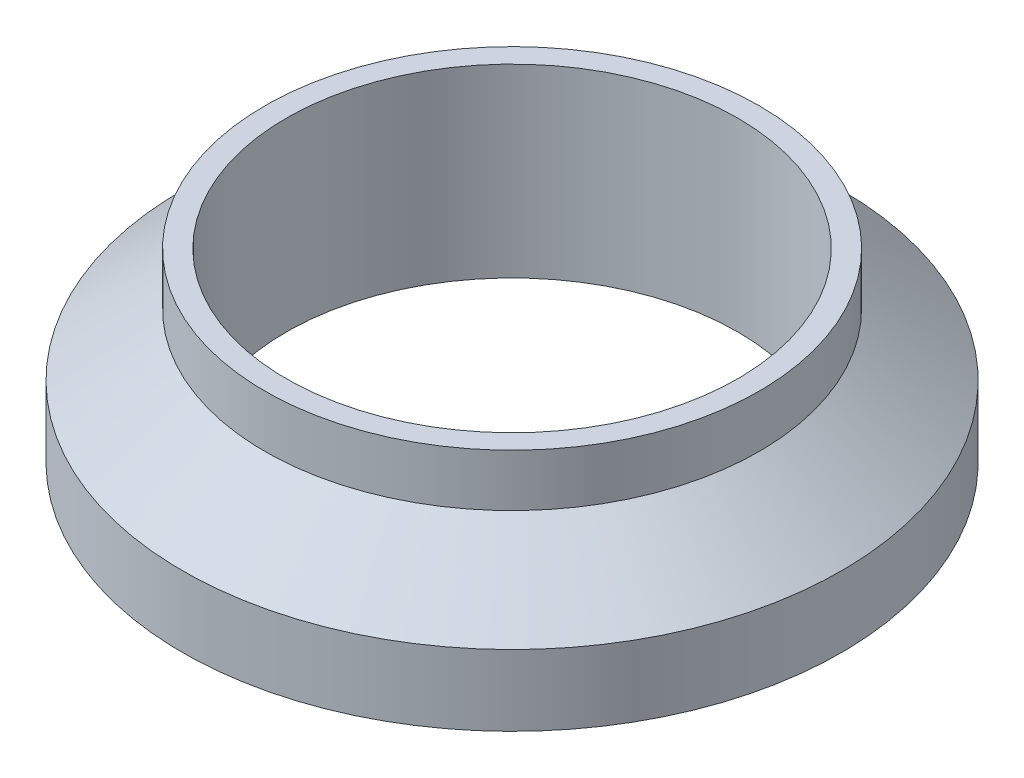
from build123d import *


with BuildPart() as part:
    # Sketch1 → Revolve1 (revolve)
    with BuildSketch(Plane.XY, mode=Mode.PRIVATE) as revolve1_sk:
        with BuildLine():
            Line((-17.399, 0), (-17.399, 14.2748))
            Line((-17.399, 14.2748), (-19.05, 14.2748))
            Line((-19.05, 14.2748), (-19.05, 10.246068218))
            Line((-19.05, 10.246068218), (-25.4, 5.461))
            Line((-25.4, 5.461), (-25.4, 0))
            Line((-25.4, 0), (-23.346616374, 0))
            ThreePointArc((-23.346616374, 0), (-21.8186, 1.1938), (-20.290583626, 0))
            Line((-20.290583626, 0), (-17.399, 0))
        make_face()
    revolve(revolve1_sk.sketch.rotate(Axis((0, 0, 0), (0, 1, 0)), 270), axis=Axis((0, 0, 0), (0, 1, 0)))


solid = part.part
